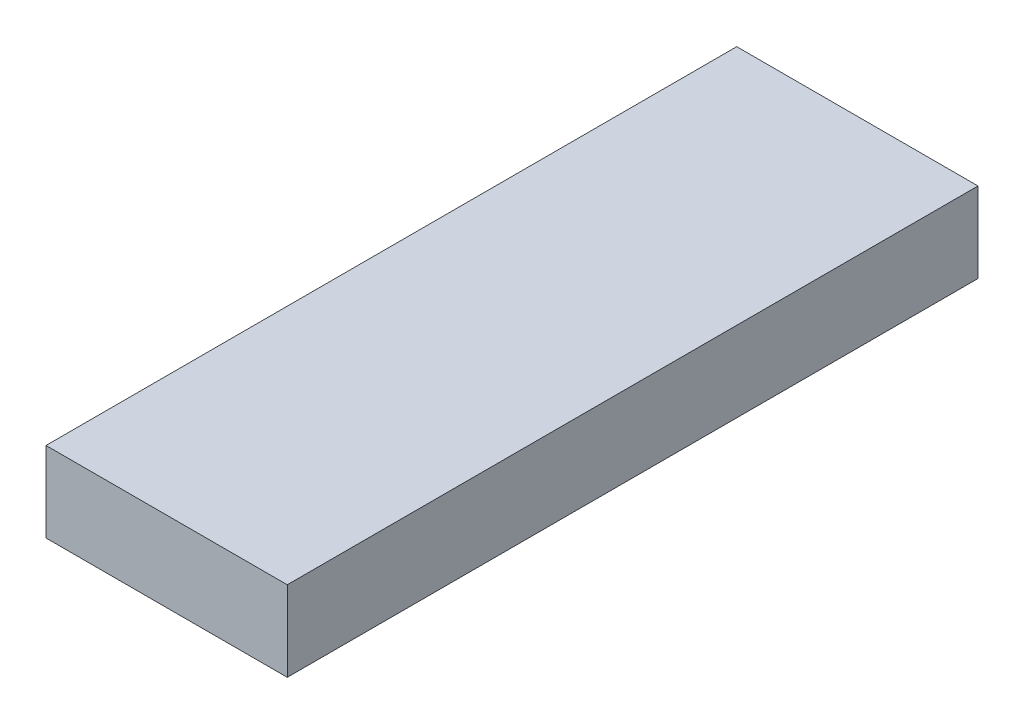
ISO-10303-21;
HEADER;
FILE_DESCRIPTION(('STEP AP214'),'2;1');
FILE_NAME('part.step','',(''),(''),'','','');
FILE_SCHEMA(('AUTOMOTIVE_DESIGN { 1 0 10303 214 1 1 1 1 }'));
ENDSEC;
DATA;
#1=APPLICATION_CONTEXT('core data for automotive mechanical design processes');
#2=APPLICATION_PROTOCOL_DEFINITION('international standard','automotive_design',2000,#1);
#3=PRODUCT_CONTEXT('',#1,'mechanical');
#4=PRODUCT('Part','Part','',(#3));
#5=PRODUCT_RELATED_PRODUCT_CATEGORY('part','',(#4));
#6=PRODUCT_DEFINITION_FORMATION('','',#4);
#7=PRODUCT_DEFINITION_CONTEXT('part definition',#1,'design');
#8=PRODUCT_DEFINITION('design','',#6,#7);
#9=PRODUCT_DEFINITION_SHAPE('','',#8);
#10=(LENGTH_UNIT() NAMED_UNIT(*) SI_UNIT(.MILLI.,.METRE.));
#11=(NAMED_UNIT(*) PLANE_ANGLE_UNIT() SI_UNIT($,.RADIAN.));
#12=(NAMED_UNIT(*) SI_UNIT($,.STERADIAN.) SOLID_ANGLE_UNIT());
#13=UNCERTAINTY_MEASURE_WITH_UNIT(LENGTH_MEASURE(1.E-05),#10,'distance_accuracy_value','');
#14=(GEOMETRIC_REPRESENTATION_CONTEXT(3) GLOBAL_UNCERTAINTY_ASSIGNED_CONTEXT((#13)) GLOBAL_UNIT_ASSIGNED_CONTEXT((#10,
#11,#12)) REPRESENTATION_CONTEXT('',''));
#15=CARTESIAN_POINT('',(0.,0.,0.));
#16=DIRECTION('',(0.,0.,1.));
#17=DIRECTION('',(1.,0.,0.));
#18=AXIS2_PLACEMENT_3D('',#15,#16,#17);
#19=CARTESIAN_POINT('',(5.45,-1.96404310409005,4.01934144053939));
#20=DIRECTION('',(0.,0.,-1.));
#21=DIRECTION('',(-1.,0.,0.));
#22=AXIS2_PLACEMENT_3D('',#19,#20,#21);
#23=PLANE('',#22);
#24=DIRECTION('',(0.,-1.,0.));
#25=VECTOR('',#24,1.);
#26=CARTESIAN_POINT('',(-5.45,-1.96404310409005,4.01934144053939));
#27=LINE('',#26,#25);
#28=CARTESIAN_POINT('',(-5.45,1.65839824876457,4.01934144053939));
#29=VERTEX_POINT('',#28);
#30=CARTESIAN_POINT('',(-5.45,-1.96404310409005,4.01934144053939));
#31=VERTEX_POINT('',#30);
#32=EDGE_CURVE('E870',#29,#31,#27,.T.);
#33=ORIENTED_EDGE('',*,*,#32,.T.);
#34=DIRECTION('',(-1.,0.,0.));
#35=VECTOR('',#34,1.);
#36=CARTESIAN_POINT('',(5.45,-1.96404310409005,4.01934144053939));
#37=LINE('',#36,#35);
#38=CARTESIAN_POINT('',(5.45,-1.96404310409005,4.01934144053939));
#39=VERTEX_POINT('',#38);
#40=EDGE_CURVE('E13',#39,#31,#37,.T.);
#41=ORIENTED_EDGE('',*,*,#40,.F.);
#42=DIRECTION('',(0.,-1.,0.));
#43=VECTOR('',#42,1.);
#44=CARTESIAN_POINT('',(5.45,-1.96404310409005,4.01934144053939));
#45=LINE('',#44,#43);
#46=CARTESIAN_POINT('',(5.45,1.65839824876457,4.01934144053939));
#47=VERTEX_POINT('',#46);
#48=EDGE_CURVE('E888',#47,#39,#45,.T.);
#49=ORIENTED_EDGE('',*,*,#48,.F.);
#50=DIRECTION('',(-1.,0.,0.));
#51=VECTOR('',#50,1.);
#52=CARTESIAN_POINT('',(5.45,1.65839824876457,4.01934144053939));
#53=LINE('',#52,#51);
#54=EDGE_CURVE('E882',#47,#29,#53,.T.);
#55=ORIENTED_EDGE('',*,*,#54,.T.);
#56=EDGE_LOOP('',(#33,#41,#49,#55));
#57=FACE_BOUND('',#56,.T.);
#58=ADVANCED_FACE('F826',(#57),#23,.F.);
#59=CARTESIAN_POINT('',(5.45,-1.96404310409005,4.01934144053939));
#60=DIRECTION('',(0.,1.,0.));
#61=DIRECTION('',(0.,0.,1.));
#62=AXIS2_PLACEMENT_3D('',#59,#60,#61);
#63=PLANE('',#62);
#64=DIRECTION('',(0.,0.,-1.));
#65=VECTOR('',#64,1.);
#66=CARTESIAN_POINT('',(-5.45,-1.96404310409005,4.01934144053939));
#67=LINE('',#66,#65);
#68=CARTESIAN_POINT('',(-5.45,-1.96404310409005,-27.1866151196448));
#69=VERTEX_POINT('',#68);
#70=EDGE_CURVE('E866',#31,#69,#67,.T.);
#71=ORIENTED_EDGE('',*,*,#70,.T.);
#72=DIRECTION('',(-1.,0.,0.));
#73=VECTOR('',#72,1.);
#74=CARTESIAN_POINT('',(5.45,-1.96404310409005,-27.1866151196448));
#75=LINE('',#74,#73);
#76=CARTESIAN_POINT('',(5.45,-1.96404310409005,-27.1866151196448));
#77=VERTEX_POINT('',#76);
#78=EDGE_CURVE('E833',#77,#69,#75,.T.);
#79=ORIENTED_EDGE('',*,*,#78,.F.);
#80=DIRECTION('',(0.,0.,-1.));
#81=VECTOR('',#80,1.);
#82=CARTESIAN_POINT('',(5.45,-1.96404310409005,4.01934144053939));
#83=LINE('',#82,#81);
#84=EDGE_CURVE('E878',#39,#77,#83,.T.);
#85=ORIENTED_EDGE('',*,*,#84,.F.);
#86=ORIENTED_EDGE('',*,*,#40,.T.);
#87=EDGE_LOOP('',(#71,#79,#85,#86));
#88=FACE_BOUND('',#87,.T.);
#89=ADVANCED_FACE('F877',(#88),#63,.F.);
#90=CARTESIAN_POINT('',(5.45,-1.96404310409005,-27.1866151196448));
#91=DIRECTION('',(0.,0.,1.));
#92=DIRECTION('',(1.,0.,0.));
#93=AXIS2_PLACEMENT_3D('',#90,#91,#92);
#94=PLANE('',#93);
#95=DIRECTION('',(0.,1.,0.));
#96=VECTOR('',#95,1.);
#97=CARTESIAN_POINT('',(-5.45,-1.96404310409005,-27.1866151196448));
#98=LINE('',#97,#96);
#99=CARTESIAN_POINT('',(-5.45,1.65839824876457,-27.1866151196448));
#100=VERTEX_POINT('',#99);
#101=EDGE_CURVE('E871',#69,#100,#98,.T.);
#102=ORIENTED_EDGE('',*,*,#101,.T.);
#103=DIRECTION('',(-1.,0.,0.));
#104=VECTOR('',#103,1.);
#105=CARTESIAN_POINT('',(5.45,1.65839824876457,-27.1866151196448));
#106=LINE('',#105,#104);
#107=CARTESIAN_POINT('',(5.45,1.65839824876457,-27.1866151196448));
#108=VERTEX_POINT('',#107);
#109=EDGE_CURVE('E894',#108,#100,#106,.T.);
#110=ORIENTED_EDGE('',*,*,#109,.F.);
#111=DIRECTION('',(0.,1.,0.));
#112=VECTOR('',#111,1.);
#113=CARTESIAN_POINT('',(5.45,-1.96404310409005,-27.1866151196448));
#114=LINE('',#113,#112);
#115=EDGE_CURVE('E845',#77,#108,#114,.T.);
#116=ORIENTED_EDGE('',*,*,#115,.F.);
#117=ORIENTED_EDGE('',*,*,#78,.T.);
#118=EDGE_LOOP('',(#102,#110,#116,#117));
#119=FACE_BOUND('',#118,.T.);
#120=ADVANCED_FACE('F897',(#119),#94,.F.);
#121=CARTESIAN_POINT('',(5.45,1.65839824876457,4.01934144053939));
#122=DIRECTION('',(0.,-1.,0.));
#123=DIRECTION('',(0.,0.,-1.));
#124=AXIS2_PLACEMENT_3D('',#121,#122,#123);
#125=PLANE('',#124);
#126=DIRECTION('',(0.,0.,1.));
#127=VECTOR('',#126,1.);
#128=CARTESIAN_POINT('',(-5.45,1.65839824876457,4.01934144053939));
#129=LINE('',#128,#127);
#130=EDGE_CURVE('E886',#100,#29,#129,.T.);
#131=ORIENTED_EDGE('',*,*,#130,.T.);
#132=ORIENTED_EDGE('',*,*,#54,.F.);
#133=DIRECTION('',(0.,0.,1.));
#134=VECTOR('',#133,1.);
#135=CARTESIAN_POINT('',(5.45,1.65839824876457,4.01934144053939));
#136=LINE('',#135,#134);
#137=EDGE_CURVE('E840',#108,#47,#136,.T.);
#138=ORIENTED_EDGE('',*,*,#137,.F.);
#139=ORIENTED_EDGE('',*,*,#109,.T.);
#140=EDGE_LOOP('',(#131,#132,#138,#139));
#141=FACE_BOUND('',#140,.T.);
#142=ADVANCED_FACE('F899',(#141),#125,.F.);
#143=CARTESIAN_POINT('',(5.45,1.65839824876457,4.01934144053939));
#144=DIRECTION('',(-1.,0.,0.));
#145=DIRECTION('',(0.,0.,1.));
#146=AXIS2_PLACEMENT_3D('',#143,#144,#145);
#147=PLANE('',#146);
#148=ORIENTED_EDGE('',*,*,#48,.T.);
#149=ORIENTED_EDGE('',*,*,#84,.T.);
#150=ORIENTED_EDGE('',*,*,#115,.T.);
#151=ORIENTED_EDGE('',*,*,#137,.T.);
#152=EDGE_LOOP('',(#148,#149,#150,#151));
#153=FACE_BOUND('',#152,.T.);
#154=ADVANCED_FACE('F900',(#153),#147,.F.);
#155=CARTESIAN_POINT('',(-5.45,1.65839824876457,4.01934144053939));
#156=DIRECTION('',(-1.,0.,0.));
#157=DIRECTION('',(0.,0.,1.));
#158=AXIS2_PLACEMENT_3D('',#155,#156,#157);
#159=PLANE('',#158);
#160=ORIENTED_EDGE('',*,*,#32,.F.);
#161=ORIENTED_EDGE('',*,*,#130,.F.);
#162=ORIENTED_EDGE('',*,*,#101,.F.);
#163=ORIENTED_EDGE('',*,*,#70,.F.);
#164=EDGE_LOOP('',(#160,#161,#162,#163));
#165=FACE_BOUND('',#164,.T.);
#166=ADVANCED_FACE('F867',(#165),#159,.T.);
#167=CLOSED_SHELL('',(#58,#89,#120,#142,#154,#166));
#168=MANIFOLD_SOLID_BREP('B2',#167);
#169=ADVANCED_BREP_SHAPE_REPRESENTATION('',(#18,#168),#14);
#170=SHAPE_DEFINITION_REPRESENTATION(#9,#169);
ENDSEC;
END-ISO-10303-21;
